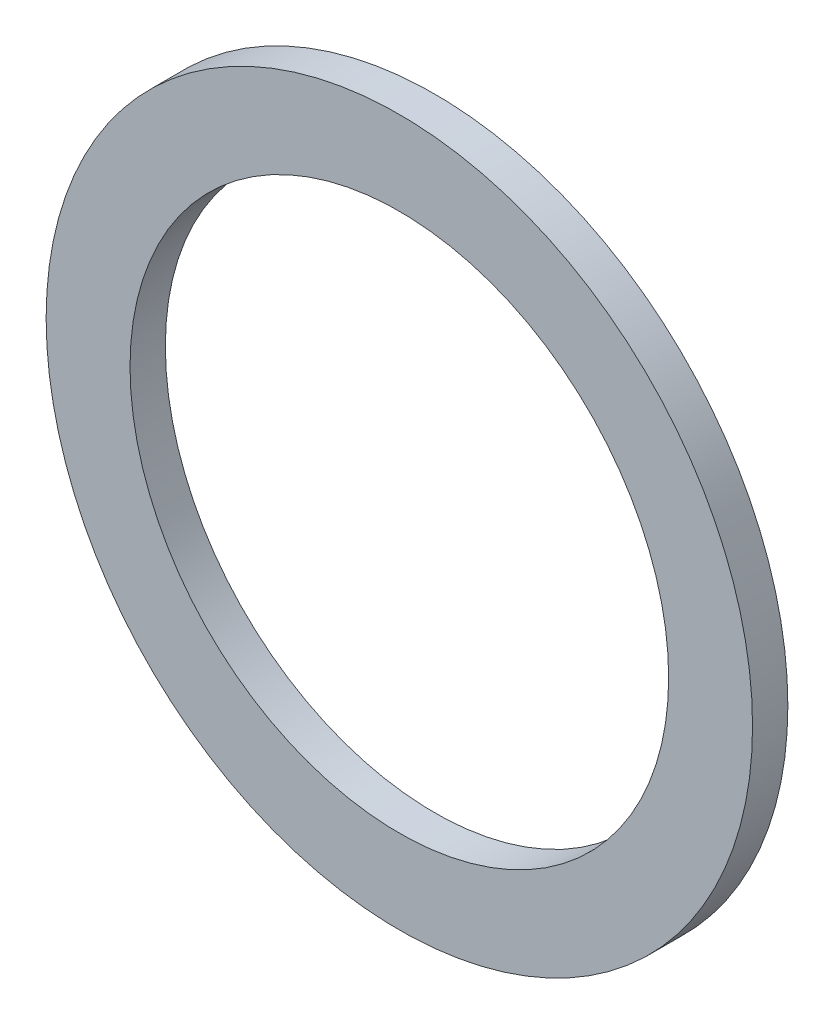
ISO-10303-21;
HEADER;
FILE_DESCRIPTION(('STEP AP214'),'2;1');
FILE_NAME('part.step','',(''),(''),'','','');
FILE_SCHEMA(('AUTOMOTIVE_DESIGN { 1 0 10303 214 1 1 1 1 }'));
ENDSEC;
DATA;
#1=APPLICATION_CONTEXT('core data for automotive mechanical design processes');
#2=APPLICATION_PROTOCOL_DEFINITION('international standard','automotive_design',2000,#1);
#3=PRODUCT_CONTEXT('',#1,'mechanical');
#4=PRODUCT('Part','Part','',(#3));
#5=PRODUCT_RELATED_PRODUCT_CATEGORY('part','',(#4));
#6=PRODUCT_DEFINITION_FORMATION('','',#4);
#7=PRODUCT_DEFINITION_CONTEXT('part definition',#1,'design');
#8=PRODUCT_DEFINITION('design','',#6,#7);
#9=PRODUCT_DEFINITION_SHAPE('','',#8);
#10=(LENGTH_UNIT() NAMED_UNIT(*) SI_UNIT(.MILLI.,.METRE.));
#11=(NAMED_UNIT(*) PLANE_ANGLE_UNIT() SI_UNIT($,.RADIAN.));
#12=(NAMED_UNIT(*) SI_UNIT($,.STERADIAN.) SOLID_ANGLE_UNIT());
#13=UNCERTAINTY_MEASURE_WITH_UNIT(LENGTH_MEASURE(1.E-05),#10,'distance_accuracy_value','');
#14=(GEOMETRIC_REPRESENTATION_CONTEXT(3) GLOBAL_UNCERTAINTY_ASSIGNED_CONTEXT((#13)) GLOBAL_UNIT_ASSIGNED_CONTEXT((#10,
#11,#12)) REPRESENTATION_CONTEXT('',''));
#15=CARTESIAN_POINT('',(0.,0.,0.));
#16=DIRECTION('',(0.,0.,1.));
#17=DIRECTION('',(1.,0.,0.));
#18=AXIS2_PLACEMENT_3D('',#15,#16,#17);
#19=CARTESIAN_POINT('',(0.,0.,2.));
#20=DIRECTION('',(0.,0.,1.));
#21=DIRECTION('',(1.,0.,0.));
#22=AXIS2_PLACEMENT_3D('',#19,#20,#21);
#23=PLANE('',#22);
#24=CARTESIAN_POINT('',(0.,0.,2.));
#25=DIRECTION('',(0.,0.,1.));
#26=DIRECTION('',(1.,0.,0.));
#27=AXIS2_PLACEMENT_3D('',#24,#25,#26);
#28=CIRCLE('',#27,20.);
#29=CARTESIAN_POINT('',(20.,0.,2.));
#30=VERTEX_POINT('',#29);
#31=EDGE_CURVE('E10',#30,#30,#28,.T.);
#32=ORIENTED_EDGE('',*,*,#31,.T.);
#33=EDGE_LOOP('',(#32));
#34=FACE_BOUND('',#33,.T.);
#35=CARTESIAN_POINT('',(0.,0.,2.));
#36=DIRECTION('',(0.,0.,1.));
#37=DIRECTION('',(1.,0.,0.));
#38=AXIS2_PLACEMENT_3D('',#35,#36,#37);
#39=CIRCLE('',#38,15.25);
#40=CARTESIAN_POINT('',(15.25,0.,2.));
#41=VERTEX_POINT('',#40);
#42=EDGE_CURVE('E39',#41,#41,#39,.T.);
#43=ORIENTED_EDGE('',*,*,#42,.F.);
#44=EDGE_LOOP('',(#43));
#45=FACE_BOUND('',#44,.T.);
#46=ADVANCED_FACE('F28',(#34,#45),#23,.T.);
#47=CARTESIAN_POINT('',(0.,0.,0.));
#48=DIRECTION('',(0.,0.,1.));
#49=DIRECTION('',(1.,0.,0.));
#50=AXIS2_PLACEMENT_3D('',#47,#48,#49);
#51=PLANE('',#50);
#52=CARTESIAN_POINT('',(0.,0.,0.));
#53=DIRECTION('',(0.,0.,1.));
#54=DIRECTION('',(1.,0.,0.));
#55=AXIS2_PLACEMENT_3D('',#52,#53,#54);
#56=CIRCLE('',#55,20.);
#57=CARTESIAN_POINT('',(20.,0.,0.));
#58=VERTEX_POINT('',#57);
#59=EDGE_CURVE('E32',#58,#58,#56,.T.);
#60=ORIENTED_EDGE('',*,*,#59,.F.);
#61=EDGE_LOOP('',(#60));
#62=FACE_BOUND('',#61,.T.);
#63=CARTESIAN_POINT('',(0.,0.,0.));
#64=DIRECTION('',(0.,0.,1.));
#65=DIRECTION('',(1.,0.,0.));
#66=AXIS2_PLACEMENT_3D('',#63,#64,#65);
#67=CIRCLE('',#66,15.25);
#68=CARTESIAN_POINT('',(15.25,0.,0.));
#69=VERTEX_POINT('',#68);
#70=EDGE_CURVE('E41',#69,#69,#67,.T.);
#71=ORIENTED_EDGE('',*,*,#70,.T.);
#72=EDGE_LOOP('',(#71));
#73=FACE_BOUND('',#72,.T.);
#74=ADVANCED_FACE('F51',(#62,#73),#51,.F.);
#75=CARTESIAN_POINT('',(0.,0.,2.));
#76=DIRECTION('',(0.,0.,-1.));
#77=DIRECTION('',(-1.,0.,0.));
#78=AXIS2_PLACEMENT_3D('',#75,#76,#77);
#79=CYLINDRICAL_SURFACE('',#78,20.);
#80=ORIENTED_EDGE('',*,*,#31,.F.);
#81=EDGE_LOOP('',(#80));
#82=FACE_BOUND('',#81,.T.);
#83=ORIENTED_EDGE('',*,*,#59,.T.);
#84=EDGE_LOOP('',(#83));
#85=FACE_BOUND('',#84,.T.);
#86=ADVANCED_FACE('F30',(#82,#85),#79,.T.);
#87=CARTESIAN_POINT('',(0.,0.,2.));
#88=DIRECTION('',(0.,0.,-1.));
#89=DIRECTION('',(-1.,0.,0.));
#90=AXIS2_PLACEMENT_3D('',#87,#88,#89);
#91=CYLINDRICAL_SURFACE('',#90,15.25);
#92=ORIENTED_EDGE('',*,*,#42,.T.);
#93=EDGE_LOOP('',(#92));
#94=FACE_BOUND('',#93,.T.);
#95=ORIENTED_EDGE('',*,*,#70,.F.);
#96=EDGE_LOOP('',(#95));
#97=FACE_BOUND('',#96,.T.);
#98=ADVANCED_FACE('F47',(#94,#97),#91,.F.);
#99=CLOSED_SHELL('',(#46,#74,#86,#98));
#100=MANIFOLD_SOLID_BREP('B2',#99);
#101=ADVANCED_BREP_SHAPE_REPRESENTATION('',(#18,#100),#14);
#102=SHAPE_DEFINITION_REPRESENTATION(#9,#101);
ENDSEC;
END-ISO-10303-21;
